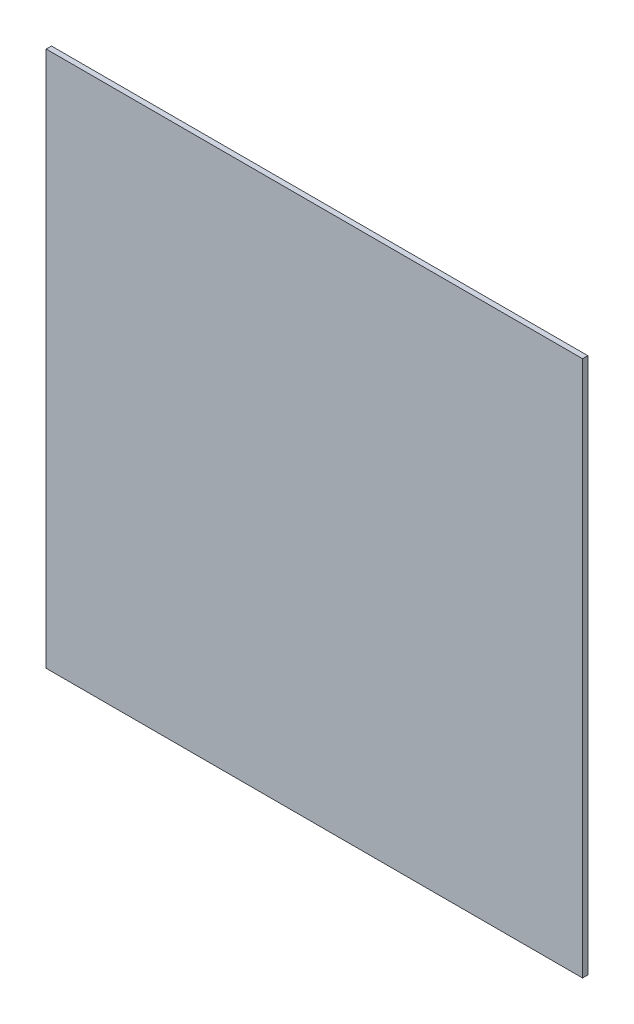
ISO-10303-21;
HEADER;
FILE_DESCRIPTION(('STEP AP214'),'2;1');
FILE_NAME('part.step','',(''),(''),'','','');
FILE_SCHEMA(('AUTOMOTIVE_DESIGN { 1 0 10303 214 1 1 1 1 }'));
ENDSEC;
DATA;
#1=APPLICATION_CONTEXT('core data for automotive mechanical design processes');
#2=APPLICATION_PROTOCOL_DEFINITION('international standard','automotive_design',2000,#1);
#3=PRODUCT_CONTEXT('',#1,'mechanical');
#4=PRODUCT('Part','Part','',(#3));
#5=PRODUCT_RELATED_PRODUCT_CATEGORY('part','',(#4));
#6=PRODUCT_DEFINITION_FORMATION('','',#4);
#7=PRODUCT_DEFINITION_CONTEXT('part definition',#1,'design');
#8=PRODUCT_DEFINITION('design','',#6,#7);
#9=PRODUCT_DEFINITION_SHAPE('','',#8);
#10=(LENGTH_UNIT() NAMED_UNIT(*) SI_UNIT(.MILLI.,.METRE.));
#11=(NAMED_UNIT(*) PLANE_ANGLE_UNIT() SI_UNIT($,.RADIAN.));
#12=(NAMED_UNIT(*) SI_UNIT($,.STERADIAN.) SOLID_ANGLE_UNIT());
#13=UNCERTAINTY_MEASURE_WITH_UNIT(LENGTH_MEASURE(1.E-05),#10,'distance_accuracy_value','');
#14=(GEOMETRIC_REPRESENTATION_CONTEXT(3) GLOBAL_UNCERTAINTY_ASSIGNED_CONTEXT((#13)) GLOBAL_UNIT_ASSIGNED_CONTEXT((#10,
#11,#12)) REPRESENTATION_CONTEXT('',''));
#15=CARTESIAN_POINT('',(0.,0.,0.));
#16=DIRECTION('',(0.,0.,1.));
#17=DIRECTION('',(1.,0.,0.));
#18=AXIS2_PLACEMENT_3D('',#15,#16,#17);
#19=CARTESIAN_POINT('',(152.4,-152.4,3.));
#20=DIRECTION('',(-1.,0.,0.));
#21=DIRECTION('',(0.,0.,1.));
#22=AXIS2_PLACEMENT_3D('',#19,#20,#21);
#23=PLANE('',#22);
#24=DIRECTION('',(0.,1.,0.));
#25=VECTOR('',#24,1.);
#26=CARTESIAN_POINT('',(152.4,-152.4,0.));
#27=LINE('',#26,#25);
#28=CARTESIAN_POINT('',(152.4,-152.4,0.));
#29=VERTEX_POINT('',#28);
#30=CARTESIAN_POINT('',(152.4,152.4,0.));
#31=VERTEX_POINT('',#30);
#32=EDGE_CURVE('E112',#29,#31,#27,.T.);
#33=ORIENTED_EDGE('',*,*,#32,.T.);
#34=DIRECTION('',(0.,0.,-1.));
#35=VECTOR('',#34,1.);
#36=CARTESIAN_POINT('',(152.4,152.4,3.));
#37=LINE('',#36,#35);
#38=CARTESIAN_POINT('',(152.4,152.4,3.));
#39=VERTEX_POINT('',#38);
#40=EDGE_CURVE('E11',#39,#31,#37,.T.);
#41=ORIENTED_EDGE('',*,*,#40,.F.);
#42=DIRECTION('',(0.,1.,0.));
#43=VECTOR('',#42,1.);
#44=CARTESIAN_POINT('',(152.4,-152.4,3.));
#45=LINE('',#44,#43);
#46=CARTESIAN_POINT('',(152.4,-152.4,3.));
#47=VERTEX_POINT('',#46);
#48=EDGE_CURVE('E98',#47,#39,#45,.T.);
#49=ORIENTED_EDGE('',*,*,#48,.F.);
#50=DIRECTION('',(0.,0.,-1.));
#51=VECTOR('',#50,1.);
#52=CARTESIAN_POINT('',(152.4,-152.4,3.));
#53=LINE('',#52,#51);
#54=EDGE_CURVE('E65',#47,#29,#53,.T.);
#55=ORIENTED_EDGE('',*,*,#54,.T.);
#56=EDGE_LOOP('',(#33,#41,#49,#55));
#57=FACE_BOUND('',#56,.T.);
#58=ADVANCED_FACE('F49',(#57),#23,.F.);
#59=CARTESIAN_POINT('',(152.4,152.4,3.));
#60=DIRECTION('',(0.,-1.,0.));
#61=DIRECTION('',(0.,0.,-1.));
#62=AXIS2_PLACEMENT_3D('',#59,#60,#61);
#63=PLANE('',#62);
#64=DIRECTION('',(-1.,0.,0.));
#65=VECTOR('',#64,1.);
#66=CARTESIAN_POINT('',(152.4,152.4,0.));
#67=LINE('',#66,#65);
#68=CARTESIAN_POINT('',(-152.4,152.4,0.));
#69=VERTEX_POINT('',#68);
#70=EDGE_CURVE('E103',#31,#69,#67,.T.);
#71=ORIENTED_EDGE('',*,*,#70,.T.);
#72=DIRECTION('',(0.,0.,-1.));
#73=VECTOR('',#72,1.);
#74=CARTESIAN_POINT('',(-152.4,152.4,3.));
#75=LINE('',#74,#73);
#76=CARTESIAN_POINT('',(-152.4,152.4,3.));
#77=VERTEX_POINT('',#76);
#78=EDGE_CURVE('E57',#77,#69,#75,.T.);
#79=ORIENTED_EDGE('',*,*,#78,.F.);
#80=DIRECTION('',(-1.,0.,0.));
#81=VECTOR('',#80,1.);
#82=CARTESIAN_POINT('',(152.4,152.4,3.));
#83=LINE('',#82,#81);
#84=EDGE_CURVE('E90',#39,#77,#83,.T.);
#85=ORIENTED_EDGE('',*,*,#84,.F.);
#86=ORIENTED_EDGE('',*,*,#40,.T.);
#87=EDGE_LOOP('',(#71,#79,#85,#86));
#88=FACE_BOUND('',#87,.T.);
#89=ADVANCED_FACE('F102',(#88),#63,.F.);
#90=CARTESIAN_POINT('',(-152.4,-152.4,3.));
#91=DIRECTION('',(-1.,0.,0.));
#92=DIRECTION('',(0.,0.,1.));
#93=AXIS2_PLACEMENT_3D('',#90,#91,#92);
#94=PLANE('',#93);
#95=DIRECTION('',(0.,1.,0.));
#96=VECTOR('',#95,1.);
#97=CARTESIAN_POINT('',(-152.4,-152.4,0.));
#98=LINE('',#97,#96);
#99=CARTESIAN_POINT('',(-152.4,-152.4,0.));
#100=VERTEX_POINT('',#99);
#101=EDGE_CURVE('E115',#100,#69,#98,.T.);
#102=ORIENTED_EDGE('',*,*,#101,.F.);
#103=DIRECTION('',(0.,0.,-1.));
#104=VECTOR('',#103,1.);
#105=CARTESIAN_POINT('',(-152.4,-152.4,3.));
#106=LINE('',#105,#104);
#107=CARTESIAN_POINT('',(-152.4,-152.4,3.));
#108=VERTEX_POINT('',#107);
#109=EDGE_CURVE('E79',#108,#100,#106,.T.);
#110=ORIENTED_EDGE('',*,*,#109,.F.);
#111=DIRECTION('',(0.,1.,0.));
#112=VECTOR('',#111,1.);
#113=CARTESIAN_POINT('',(-152.4,-152.4,3.));
#114=LINE('',#113,#112);
#115=EDGE_CURVE('E97',#108,#77,#114,.T.);
#116=ORIENTED_EDGE('',*,*,#115,.T.);
#117=ORIENTED_EDGE('',*,*,#78,.T.);
#118=EDGE_LOOP('',(#102,#110,#116,#117));
#119=FACE_BOUND('',#118,.T.);
#120=ADVANCED_FACE('F106',(#119),#94,.T.);
#121=CARTESIAN_POINT('',(152.4,-152.4,3.));
#122=DIRECTION('',(0.,-1.,0.));
#123=DIRECTION('',(0.,0.,-1.));
#124=AXIS2_PLACEMENT_3D('',#121,#122,#123);
#125=PLANE('',#124);
#126=DIRECTION('',(-1.,0.,0.));
#127=VECTOR('',#126,1.);
#128=CARTESIAN_POINT('',(152.4,-152.4,0.));
#129=LINE('',#128,#127);
#130=EDGE_CURVE('E117',#29,#100,#129,.T.);
#131=ORIENTED_EDGE('',*,*,#130,.F.);
#132=ORIENTED_EDGE('',*,*,#54,.F.);
#133=DIRECTION('',(-1.,0.,0.));
#134=VECTOR('',#133,1.);
#135=CARTESIAN_POINT('',(152.4,-152.4,3.));
#136=LINE('',#135,#134);
#137=EDGE_CURVE('E107',#47,#108,#136,.T.);
#138=ORIENTED_EDGE('',*,*,#137,.T.);
#139=ORIENTED_EDGE('',*,*,#109,.T.);
#140=EDGE_LOOP('',(#131,#132,#138,#139));
#141=FACE_BOUND('',#140,.T.);
#142=ADVANCED_FACE('F123',(#141),#125,.T.);
#143=CARTESIAN_POINT('',(0.,0.,3.));
#144=DIRECTION('',(0.,0.,1.));
#145=DIRECTION('',(1.,0.,0.));
#146=AXIS2_PLACEMENT_3D('',#143,#144,#145);
#147=PLANE('',#146);
#148=ORIENTED_EDGE('',*,*,#48,.T.);
#149=ORIENTED_EDGE('',*,*,#84,.T.);
#150=ORIENTED_EDGE('',*,*,#115,.F.);
#151=ORIENTED_EDGE('',*,*,#137,.F.);
#152=EDGE_LOOP('',(#148,#149,#150,#151));
#153=FACE_BOUND('',#152,.T.);
#154=ADVANCED_FACE('F94',(#153),#147,.T.);
#155=CARTESIAN_POINT('',(0.,0.,0.));
#156=DIRECTION('',(0.,0.,1.));
#157=DIRECTION('',(1.,0.,0.));
#158=AXIS2_PLACEMENT_3D('',#155,#156,#157);
#159=PLANE('',#158);
#160=ORIENTED_EDGE('',*,*,#32,.F.);
#161=ORIENTED_EDGE('',*,*,#130,.T.);
#162=ORIENTED_EDGE('',*,*,#101,.T.);
#163=ORIENTED_EDGE('',*,*,#70,.F.);
#164=EDGE_LOOP('',(#160,#161,#162,#163));
#165=FACE_BOUND('',#164,.T.);
#166=ADVANCED_FACE('F122',(#165),#159,.F.);
#167=CLOSED_SHELL('',(#58,#89,#120,#142,#154,#166));
#168=MANIFOLD_SOLID_BREP('B2',#167);
#169=ADVANCED_BREP_SHAPE_REPRESENTATION('',(#18,#168),#14);
#170=SHAPE_DEFINITION_REPRESENTATION(#9,#169);
ENDSEC;
END-ISO-10303-21;
